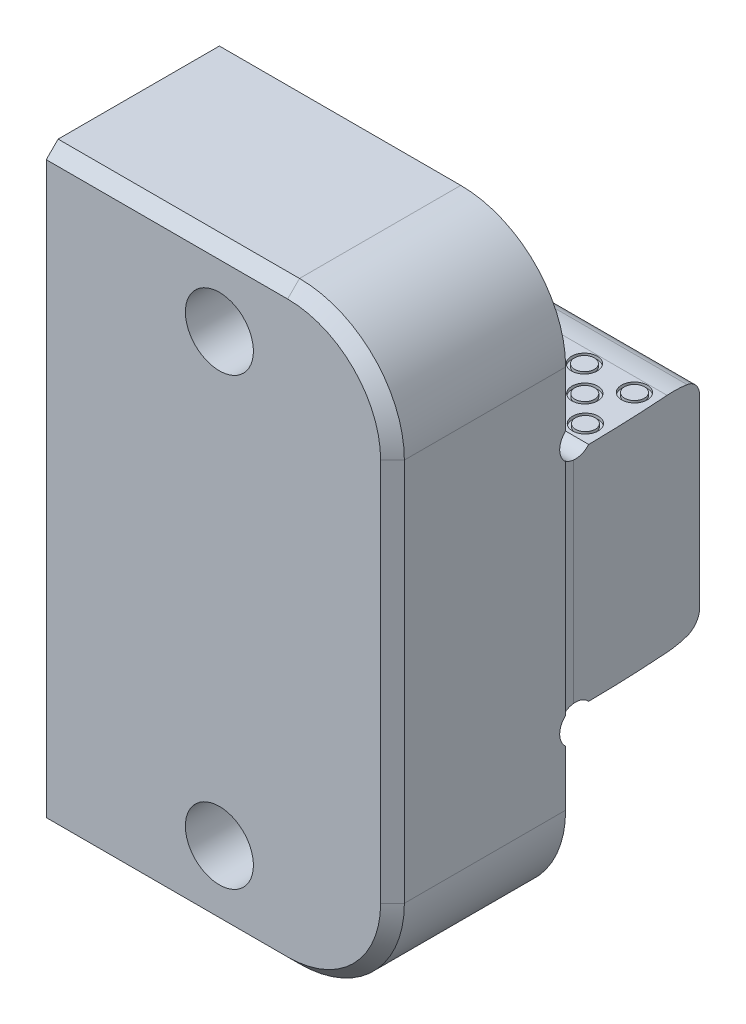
from build123d import *

# Parameters (mm, degrees)
EXTRUDE1_DEPTH              = 22.225
SKETCH7_W                   = 21.968267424
SKETCH7_H                   = 31.720833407
CUT_EXTRUDE3_DEPTH          = 0.254
SKETCH8_R                   = 2.286
CUT_EXTRUDE4_DEPTH          = 63.620788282
CUT_EXTRUDE5_DEPTH          = 63.620788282
CUT_EXTRUDE6_DEPTH          = 83.427794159
SKETCH15_R                  = 1.651
SKETCH15_R_2                = 1.27
CUT_EXTRUDE7_DEPTH          = 0.381
F_5_16_18_CBORE_D           = 8.72998
F_5_16_18_CBORE_CBORE_D     = 13.49502
F_5_16_18_CBORE_CBORE_DEPTH = 8.73125
FILLET1_R                   = 13.462
CHAMFER1_SIZE               = 1.524


with BuildPart() as part:
    # Sketch3 → Extrude1 (new, symmetric)
    with BuildSketch(Plane(origin=(0, 0, 0), x_dir=(0, 0, -1), z_dir=(1, 0, 0))):
        Polygon((-22.225, -38.1), (0, -38.1), (0, -14.28496), (18.288, -14.28496), (18.288, 14.28496), (0, 14.28496), (0, 38.1), (-22.225, 38.1), align=None)
    extrude(amount=EXTRUDE1_DEPTH, both=True)

    # Sketch7 → Cut-Extrude3 (cut)
    with BuildSketch(Plane(origin=(22.225, 0, 0), x_dir=(0, 0, -1), z_dir=(1, 0, 0))):
        with Locations((10.984133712, 1.307835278)):
            Rectangle(SKETCH7_W, SKETCH7_H)
    extrude(amount=-CUT_EXTRUDE3_DEPTH, mode=Mode.SUBTRACT)

    # Sketch8 → Cut-Extrude4 (cut, through all)
    with BuildSketch(Plane(origin=(22.225, 0, 0), x_dir=(0, 0, -1), z_dir=(1, 0, 0))):
        with Locations((1.524, 15.80896)):
            Circle(SKETCH8_R)
        with Locations((1.524, -15.80896)):
            Circle(SKETCH8_R)
    extrude(amount=-CUT_EXTRUDE4_DEPTH, mode=Mode.SUBTRACT)

    # Sketch9 → Cut-Extrude5 (cut, through all)
    with BuildSketch(Plane(origin=(22.225, 0, 0), x_dir=(0, 0, -1), z_dir=(1, 0, 0))):
        with BuildLine():
            Line((18.288, 11.74496), (20.066, 11.74496))
            Line((20.066, 11.74496), (20.066, 18.09496))
            Line((20.066, 18.09496), (13.716, 18.09496))
            Line((13.716, 18.09496), (13.716, 14.28496))
            ThreePointArc((13.716, 14.28496), (15.118480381, 14.20728343), (16.503804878, 13.975203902))
            ThreePointArc((16.503804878, 13.975203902), (17.787066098, 13.173012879), (18.288, 11.74496))
        make_face()
        with BuildLine():
            Line((20.066, -11.74496), (20.066, -18.09496))
            Line((20.066, -18.09496), (13.716, -18.09496))
            Line((13.716, -18.09496), (13.716, -14.28496))
            ThreePointArc((13.716, -14.28496), (15.118480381, -14.20728343), (16.503804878, -13.975203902))
            ThreePointArc((16.503804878, -13.975203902), (17.787066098, -13.173012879), (18.288, -11.74496))
            Line((18.288, -11.74496), (20.066, -11.74496))
        make_face()
    extrude(amount=-CUT_EXTRUDE5_DEPTH, mode=Mode.SUBTRACT)

    # Sketch13 → Cut-Extrude6 (cut, through all)
    with BuildSketch(Plane(origin=(0, 38.1, 0), x_dir=(1, 0, 0), z_dir=(0, 1, 0))):
        with BuildLine():
            Line((20.147362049, 26.67), (32.847362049, 26.67))
            Line((32.847362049, 26.67), (32.847362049, 1.27))
            Line((32.847362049, 1.27), (21.971, 1.27))
            ThreePointArc((21.971, 1.27), (21.514504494, 14.002690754), (20.147362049, 26.67))
        make_face()
    extrude(amount=-CUT_EXTRUDE6_DEPTH, mode=Mode.SUBTRACT)

    # Sketch15 → Cut-Extrude7 (cut)
    # profile 1 of 20: a face of its own
    with BuildSketch(Plane(origin=(0, 14.28496, 0), x_dir=(1, 0, 0), z_dir=(0, 1, 0))):
        with Locations(Location((-13.0048, 11.938, 0), (0, 0, 270))):
            Circle(SKETCH15_R)
        with Locations(Location((-13.0048, 11.938, 0), (0, 0, 270))):
            Circle(SKETCH15_R_2, mode=Mode.SUBTRACT)
    # profile 2 of 20: a face of its own
    with BuildSketch(Plane(origin=(0, 14.28496, 0), x_dir=(1, 0, 0), z_dir=(0, 1, 0))):
        with Locations(Location((-6.5786, 11.938, 0), (0, 0, 270))):
            Circle(SKETCH15_R)
        with Locations(Location((-6.5786, 11.938, 0), (0, 0, 270))):
            Circle(SKETCH15_R_2, mode=Mode.SUBTRACT)
    # profile 3 of 20: a face of its own
    with BuildSketch(Plane(origin=(0, 14.28496, 0), x_dir=(1, 0, 0), z_dir=(0, 1, 0))):
        with Locations(Location((-19.431, 11.938, 0), (0, 0, 270))):
            Circle(SKETCH15_R)
        with Locations(Location((-19.431, 11.938, 0), (0, 0, 270))):
            Circle(SKETCH15_R_2, mode=Mode.SUBTRACT)
    # profile 4 of 20: a face of its own
    with BuildSketch(Plane(origin=(0, 14.28496, 0), x_dir=(1, 0, 0), z_dir=(0, 1, 0))):
        with Locations(Location((-0.1524, 11.938, 0), (0, 0, 270))):
            Circle(SKETCH15_R)
        with Locations(Location((-0.1524, 11.938, 0), (0, 0, 270))):
            Circle(SKETCH15_R_2, mode=Mode.SUBTRACT)
    # profile 5 of 20: a face of its own
    with BuildSketch(Plane(origin=(0, 14.28496, 0), x_dir=(1, 0, 0), z_dir=(0, 1, 0))):
        with Locations(Location((6.2738, 11.938, 0), (0, 0, 270))):
            Circle(SKETCH15_R)
        with Locations(Location((6.2738, 11.938, 0), (0, 0, 270))):
            Circle(SKETCH15_R_2, mode=Mode.SUBTRACT)
    # profile 6 of 20: a face of its own
    with BuildSketch(Plane(origin=(0, 14.28496, 0), x_dir=(1, 0, 0), z_dir=(0, 1, 0))):
        with Locations(Location((12.7, 11.938, 0), (0, 0, 270))):
            Circle(SKETCH15_R)
        with Locations(Location((12.7, 11.938, 0), (0, 0, 270))):
            Circle(SKETCH15_R_2, mode=Mode.SUBTRACT)
    # profile 7 of 20: a face of its own
    with BuildSketch(Plane(origin=(0, 14.28496, 0), x_dir=(1, 0, 0), z_dir=(0, 1, 0))):
        with Locations(Location((19.1262, 11.938, 0), (0, 0, 270))):
            Circle(SKETCH15_R)
        with Locations(Location((19.1262, 11.938, 0), (0, 0, 270))):
            Circle(SKETCH15_R_2, mode=Mode.SUBTRACT)
    # profile 8 of 20: a face of its own
    with BuildSketch(Plane(origin=(0, 14.28496, 0), x_dir=(1, 0, 0), z_dir=(0, 1, 0))):
        with Locations(Location((-9.7536, 8.636, 0), (0, 0, 270))):
            Circle(SKETCH15_R)
        with Locations(Location((-9.7536, 8.636, 0), (0, 0, 270))):
            Circle(SKETCH15_R_2, mode=Mode.SUBTRACT)
    # profile 9 of 20: a face of its own
    with BuildSketch(Plane(origin=(0, 14.28496, 0), x_dir=(1, 0, 0), z_dir=(0, 1, 0))):
        with Locations(Location((-3.302, 8.636, 0), (0, 0, 270))):
            Circle(SKETCH15_R)
        with Locations(Location((-3.302, 8.636, 0), (0, 0, 270))):
            Circle(SKETCH15_R_2, mode=Mode.SUBTRACT)
    # profile 10 of 20: a face of its own
    with BuildSketch(Plane(origin=(0, 14.28496, 0), x_dir=(1, 0, 0), z_dir=(0, 1, 0))):
        with Locations(Location((-16.2052, 8.636, 0), (0, 0, 270))):
            Circle(SKETCH15_R)
        with Locations(Location((-16.2052, 8.636, 0), (0, 0, 270))):
            Circle(SKETCH15_R_2, mode=Mode.SUBTRACT)
    # profile 11 of 20: a face of its own
    with BuildSketch(Plane(origin=(0, 14.28496, 0), x_dir=(1, 0, 0), z_dir=(0, 1, 0))):
        with Locations(Location((3.1496, 8.636, 0), (0, 0, 270))):
            Circle(SKETCH15_R)
        with Locations(Location((3.1496, 8.636, 0), (0, 0, 270))):
            Circle(SKETCH15_R_2, mode=Mode.SUBTRACT)
    # profile 12 of 20: a face of its own
    with BuildSketch(Plane(origin=(0, 14.28496, 0), x_dir=(1, 0, 0), z_dir=(0, 1, 0))):
        with Locations(Location((9.6012, 8.636, 0), (0, 0, 270))):
            Circle(SKETCH15_R)
        with Locations(Location((9.6012, 8.636, 0), (0, 0, 270))):
            Circle(SKETCH15_R_2, mode=Mode.SUBTRACT)
    # profile 13 of 20: a face of its own
    with BuildSketch(Plane(origin=(0, 14.28496, 0), x_dir=(1, 0, 0), z_dir=(0, 1, 0))):
        with Locations(Location((16.0528, 8.636, 0), (0, 0, 270))):
            Circle(SKETCH15_R)
        with Locations(Location((16.0528, 8.636, 0), (0, 0, 270))):
            Circle(SKETCH15_R_2, mode=Mode.SUBTRACT)
    # profile 14 of 20: a face of its own
    with BuildSketch(Plane(origin=(0, 14.28496, 0), x_dir=(1, 0, 0), z_dir=(0, 1, 0))):
        with Locations(Location((-12.954, 5.334, 0), (0, 0, 270))):
            Circle(SKETCH15_R)
        with Locations(Location((-12.954, 5.334, 0), (0, 0, 270))):
            Circle(SKETCH15_R_2, mode=Mode.SUBTRACT)
    # profile 15 of 20: a face of its own
    with BuildSketch(Plane(origin=(0, 14.28496, 0), x_dir=(1, 0, 0), z_dir=(0, 1, 0))):
        with Locations(Location((-6.477, 5.334, 0), (0, 0, 270))):
            Circle(SKETCH15_R)
        with Locations(Location((-6.477, 5.334, 0), (0, 0, 270))):
            Circle(SKETCH15_R_2, mode=Mode.SUBTRACT)
    # profile 16 of 20: a face of its own
    with BuildSketch(Plane(origin=(0, 14.28496, 0), x_dir=(1, 0, 0), z_dir=(0, 1, 0))):
        with Locations(Location((-19.431, 5.334, 0), (0, 0, 270))):
            Circle(SKETCH15_R)
        with Locations(Location((-19.431, 5.334, 0), (0, 0, 270))):
            Circle(SKETCH15_R_2, mode=Mode.SUBTRACT)
    # profile 17 of 20: a face of its own
    with BuildSketch(Plane(origin=(0, 14.28496, 0), x_dir=(1, 0, 0), z_dir=(0, 1, 0))):
        with Locations(Location((0, 5.334, 0), (0, 0, 270))):
            Circle(SKETCH15_R)
        with Locations(Location((0, 5.334, 0), (0, 0, 270))):
            Circle(SKETCH15_R_2, mode=Mode.SUBTRACT)
    # profile 18 of 20: a face of its own
    with BuildSketch(Plane(origin=(0, 14.28496, 0), x_dir=(1, 0, 0), z_dir=(0, 1, 0))):
        with Locations(Location((6.477, 5.334, 0), (0, 0, 270))):
            Circle(SKETCH15_R)
        with Locations(Location((6.477, 5.334, 0), (0, 0, 270))):
            Circle(SKETCH15_R_2, mode=Mode.SUBTRACT)
    # profile 19 of 20: a face of its own
    with BuildSketch(Plane(origin=(0, 14.28496, 0), x_dir=(1, 0, 0), z_dir=(0, 1, 0))):
        with Locations(Location((12.954, 5.334, 0), (0, 0, 270))):
            Circle(SKETCH15_R)
        with Locations(Location((12.954, 5.334, 0), (0, 0, 270))):
            Circle(SKETCH15_R_2, mode=Mode.SUBTRACT)
    # profile 20 of 20: a face of its own
    with BuildSketch(Plane(origin=(0, 14.28496, 0), x_dir=(1, 0, 0), z_dir=(0, 1, 0))):
        with Locations(Location((19.431, 5.334, 0), (0, 0, 270))):
            Circle(SKETCH15_R)
        with Locations(Location((19.431, 5.334, 0), (0, 0, 270))):
            Circle(SKETCH15_R_2, mode=Mode.SUBTRACT)
    cut_extrude7 = extrude(amount=-CUT_EXTRUDE7_DEPTH, mode=Mode.SUBTRACT)

    # Mirror1: Cut-Extrude7 across plane
    add(cut_extrude7.mirror(Plane.ZX), mode=Mode.SUBTRACT)

    # 5_16_-18 CBORE (through all)
    with Locations(Plane(origin=(0, 0, 0), x_dir=(-1, 0, 0), z_dir=(0, 0, -1))):
        with Locations((0, 28.575), (0, -28.575)):
            CounterBoreHole(F_5_16_18_CBORE_D / 2, F_5_16_18_CBORE_CBORE_D / 2, F_5_16_18_CBORE_CBORE_DEPTH)

    # Fillet1
    fillet1_edges = [part.edges().sort_by_distance(p)[0] for p in [
        (22.225, 38.1, 11.1125),
        (22.225, -38.1, 11.1125),
    ]]
    fillet(fillet1_edges, radius=FILLET1_R)

    # Chamfer1
    chamfer1_edges = [part.edges().sort_by_distance(p)[0] for p in [
        (22.225, 0, 22.225),
        (-6.731, -38.1, 22.225),
        (-6.731, 38.1, 22.225),
        (18.282071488, 34.157071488, 22.225),
        (18.282071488, -34.157071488, 22.225),
    ]]
    chamfer(chamfer1_edges, length=CHAMFER1_SIZE)


solid = part.part
